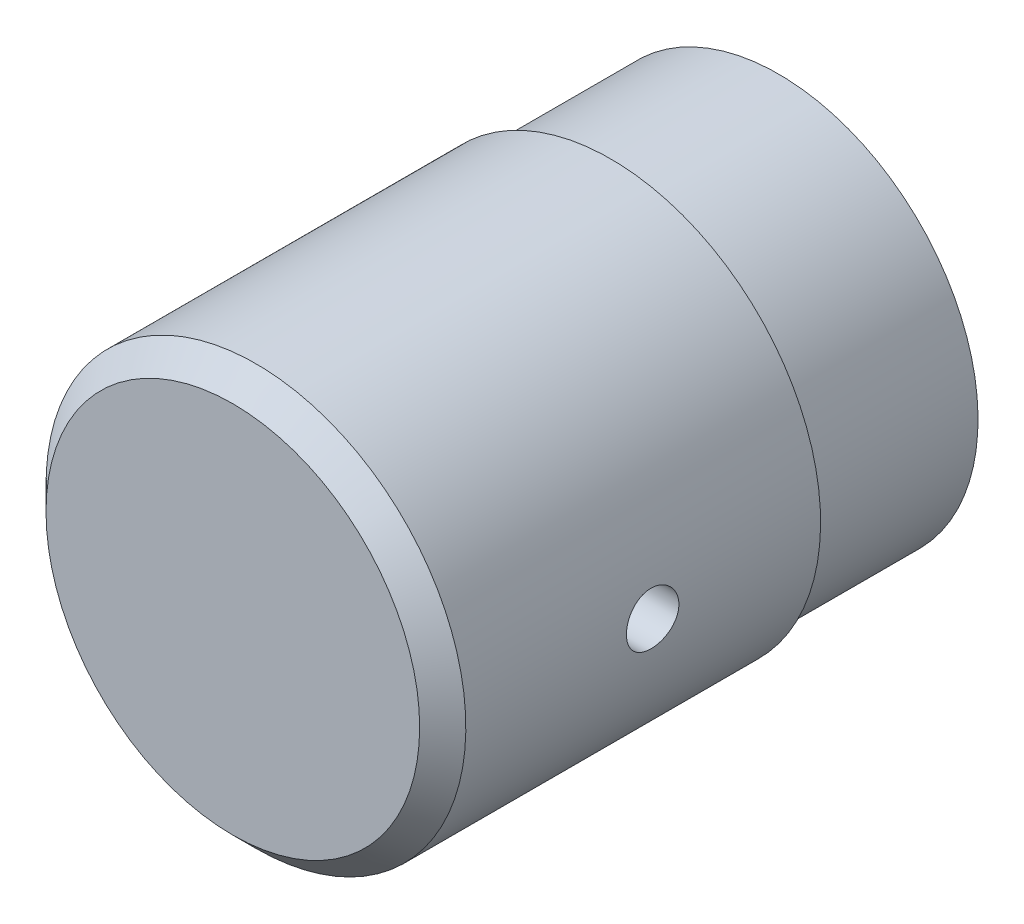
ISO-10303-21;
HEADER;
FILE_DESCRIPTION(('STEP AP214'),'2;1');
FILE_NAME('part.step','',(''),(''),'','','');
FILE_SCHEMA(('AUTOMOTIVE_DESIGN { 1 0 10303 214 1 1 1 1 }'));
ENDSEC;
DATA;
#1=APPLICATION_CONTEXT('core data for automotive mechanical design processes');
#2=APPLICATION_PROTOCOL_DEFINITION('international standard','automotive_design',2000,#1);
#3=PRODUCT_CONTEXT('',#1,'mechanical');
#4=PRODUCT('Part','Part','',(#3));
#5=PRODUCT_RELATED_PRODUCT_CATEGORY('part','',(#4));
#6=PRODUCT_DEFINITION_FORMATION('','',#4);
#7=PRODUCT_DEFINITION_CONTEXT('part definition',#1,'design');
#8=PRODUCT_DEFINITION('design','',#6,#7);
#9=PRODUCT_DEFINITION_SHAPE('','',#8);
#10=(LENGTH_UNIT() NAMED_UNIT(*) SI_UNIT(.MILLI.,.METRE.));
#11=(NAMED_UNIT(*) PLANE_ANGLE_UNIT() SI_UNIT($,.RADIAN.));
#12=(NAMED_UNIT(*) SI_UNIT($,.STERADIAN.) SOLID_ANGLE_UNIT());
#13=UNCERTAINTY_MEASURE_WITH_UNIT(LENGTH_MEASURE(1.E-05),#10,'distance_accuracy_value','');
#14=(GEOMETRIC_REPRESENTATION_CONTEXT(3) GLOBAL_UNCERTAINTY_ASSIGNED_CONTEXT((#13)) GLOBAL_UNIT_ASSIGNED_CONTEXT((#10,
#11,#12)) REPRESENTATION_CONTEXT('',''));
#15=CARTESIAN_POINT('',(0.,0.,0.));
#16=DIRECTION('',(0.,0.,1.));
#17=DIRECTION('',(1.,0.,0.));
#18=AXIS2_PLACEMENT_3D('',#15,#16,#17);
#19=CARTESIAN_POINT('',(0.,0.,0.490836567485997));
#20=DIRECTION('',(0.,0.,-1.));
#21=DIRECTION('',(0.,-1.,0.));
#22=AXIS2_PLACEMENT_3D('',#19,#20,#21);
#23=CYLINDRICAL_SURFACE('',#22,20.);
#24=CARTESIAN_POINT('',(0.,0.,16.));
#25=DIRECTION('',(0.,0.,-1.));
#26=DIRECTION('',(0.,-1.,0.));
#27=AXIS2_PLACEMENT_3D('',#24,#25,#26);
#28=CIRCLE('',#27,20.);
#29=CARTESIAN_POINT('',(0.,-20.,16.));
#30=VERTEX_POINT('',#29);
#31=EDGE_CURVE('E37',#30,#30,#28,.T.);
#32=ORIENTED_EDGE('',*,*,#31,.F.);
#33=EDGE_LOOP('',(#32));
#34=FACE_BOUND('',#33,.T.);
#35=CARTESIAN_POINT('',(0.,0.,49.8));
#36=DIRECTION('',(0.,0.,-1.));
#37=DIRECTION('',(0.,-1.,0.));
#38=AXIS2_PLACEMENT_3D('',#35,#36,#37);
#39=CIRCLE('',#38,20.);
#40=CARTESIAN_POINT('',(0.,-20.,49.8));
#41=VERTEX_POINT('',#40);
#42=EDGE_CURVE('E40',#41,#41,#39,.T.);
#43=ORIENTED_EDGE('',*,*,#42,.T.);
#44=EDGE_LOOP('',(#43));
#45=FACE_BOUND('',#44,.T.);
#46=CARTESIAN_POINT('',(19.8431348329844,2.5,32.));
#47=CARTESIAN_POINT('',(19.8431368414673,2.49999405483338,31.8601637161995));
#48=CARTESIAN_POINT('',(19.8446289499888,2.48822789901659,31.7202400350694));
#49=CARTESIAN_POINT('',(19.8504339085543,2.44147641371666,31.4442867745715));
#50=CARTESIAN_POINT('',(19.854749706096,2.4064668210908,31.3082614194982));
#51=CARTESIAN_POINT('',(19.8657057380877,2.31427669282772,31.0441401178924));
#52=CARTESIAN_POINT('',(19.8723443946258,2.2571112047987,30.9160388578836));
#53=CARTESIAN_POINT('',(19.8871962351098,2.12226419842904,30.6712715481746));
#54=CARTESIAN_POINT('',(19.8954091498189,2.04458618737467,30.5546035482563));
#55=CARTESIAN_POINT('',(19.9125355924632,1.87045345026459,30.3353377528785));
#56=CARTESIAN_POINT('',(19.9214524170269,1.7739068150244,30.2328131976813));
#57=CARTESIAN_POINT('',(19.9389523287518,1.56497526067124,30.0453772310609));
#58=CARTESIAN_POINT('',(19.9475353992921,1.45258955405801,29.9604666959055));
#59=CARTESIAN_POINT('',(19.96343444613,1.21470983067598,29.8104064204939));
#60=CARTESIAN_POINT('',(19.9707461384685,1.08917369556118,29.7453229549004));
#61=CARTESIAN_POINT('',(19.9832423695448,0.82884671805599,29.637188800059));
#62=CARTESIAN_POINT('',(19.9884269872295,0.694056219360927,29.5941372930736));
#63=CARTESIAN_POINT('',(19.9960616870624,0.419795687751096,29.5315079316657));
#64=CARTESIAN_POINT('',(19.9985259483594,0.280353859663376,29.5118083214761));
#65=CARTESIAN_POINT('',(20.0004906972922,0.000123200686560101,29.4960646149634));
#66=CARTESIAN_POINT('',(19.9999913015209,-0.140665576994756,29.5000195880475));
#67=CARTESIAN_POINT('',(19.9960964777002,-0.418765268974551,29.5313752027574));
#68=CARTESIAN_POINT('',(19.9927172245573,-0.556091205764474,29.5586448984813));
#69=CARTESIAN_POINT('',(19.9834605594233,-0.824202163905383,29.63565117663));
#70=CARTESIAN_POINT('',(19.9775830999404,-0.954987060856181,29.685388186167));
#71=CARTESIAN_POINT('',(19.9639625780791,-1.20670881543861,29.806056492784));
#72=CARTESIAN_POINT('',(19.9562145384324,-1.32761822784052,29.8770444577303));
#73=CARTESIAN_POINT('',(19.9397196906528,-1.5558574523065,30.038158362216));
#74=CARTESIAN_POINT('',(19.9309728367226,-1.66318664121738,30.1282851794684));
#75=CARTESIAN_POINT('',(19.9133886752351,-1.86198803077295,30.3258518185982));
#76=CARTESIAN_POINT('',(19.9045511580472,-1.95334683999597,30.4334057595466));
#77=CARTESIAN_POINT('',(19.8878407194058,-2.11673285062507,30.6623815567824));
#78=CARTESIAN_POINT('',(19.8799678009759,-2.18875999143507,30.7838034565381));
#79=CARTESIAN_POINT('',(19.8660780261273,-2.31144457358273,31.0371694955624));
#80=CARTESIAN_POINT('',(19.8600619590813,-2.36209292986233,31.1691180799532));
#81=CARTESIAN_POINT('',(19.8505824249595,-2.44048165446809,31.4397394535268));
#82=CARTESIAN_POINT('',(19.847118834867,-2.46822312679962,31.5784119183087));
#83=CARTESIAN_POINT('',(19.8431588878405,-2.49986043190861,31.8575431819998));
#84=CARTESIAN_POINT('',(19.8426426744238,-2.50391584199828,31.9979836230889));
#85=CARTESIAN_POINT('',(19.8445834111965,-2.48848695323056,32.2775419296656));
#86=CARTESIAN_POINT('',(19.8470402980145,-2.46900315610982,32.4166598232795));
#87=CARTESIAN_POINT('',(19.8546322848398,-2.40718328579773,32.689145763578));
#88=CARTESIAN_POINT('',(19.8597583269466,-2.36492448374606,32.8225316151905));
#89=CARTESIAN_POINT('',(19.8721036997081,-2.25883371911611,33.0803241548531));
#90=CARTESIAN_POINT('',(19.8793231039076,-2.1950009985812,33.2047305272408));
#91=CARTESIAN_POINT('',(19.8950893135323,-2.04718202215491,33.4417546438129));
#92=CARTESIAN_POINT('',(19.9036429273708,-1.96309111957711,33.5543066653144));
#93=CARTESIAN_POINT('',(19.9210923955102,-1.77729074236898,33.7637565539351));
#94=CARTESIAN_POINT('',(19.9299882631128,-1.67558058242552,33.8606538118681));
#95=CARTESIAN_POINT('',(19.9471808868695,-1.45673177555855,34.0366041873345));
#96=CARTESIAN_POINT('',(19.9554739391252,-1.33950849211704,34.115552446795));
#97=CARTESIAN_POINT('',(19.9704711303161,-1.09337258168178,34.2526382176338));
#98=CARTESIAN_POINT('',(19.9771753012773,-0.964460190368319,34.310776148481));
#99=CARTESIAN_POINT('',(19.988222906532,-0.698953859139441,34.404417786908));
#100=CARTESIAN_POINT('',(19.9925726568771,-0.562381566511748,34.4399820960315));
#101=CARTESIAN_POINT('',(19.9984475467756,-0.285146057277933,34.4876640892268));
#102=CARTESIAN_POINT('',(19.9999728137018,-0.144483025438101,34.4997828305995));
#103=CARTESIAN_POINT('',(20.0000262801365,0.135917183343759,34.5002099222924));
#104=CARTESIAN_POINT('',(19.998574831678,0.275654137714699,34.4886799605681));
#105=CARTESIAN_POINT('',(19.9928784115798,0.551187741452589,34.4424793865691));
#106=CARTESIAN_POINT('',(19.9886334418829,0.686984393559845,34.407808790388));
#107=CARTESIAN_POINT('',(19.9778248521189,0.950761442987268,34.3163618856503));
#108=CARTESIAN_POINT('',(19.9712620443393,1.07874456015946,34.259593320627));
#109=CARTESIAN_POINT('',(19.9565444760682,1.32339333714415,34.1255786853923));
#110=CARTESIAN_POINT('',(19.9483896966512,1.44005886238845,34.0483323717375));
#111=CARTESIAN_POINT('',(19.9313319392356,1.65958676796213,33.8749567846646));
#112=CARTESIAN_POINT('',(19.9224244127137,1.76235378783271,33.7787072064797));
#113=CARTESIAN_POINT('',(19.9049015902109,1.95034111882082,33.5703070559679));
#114=CARTESIAN_POINT('',(19.8962863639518,2.03555726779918,33.4581527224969));
#115=CARTESIAN_POINT('',(19.8802881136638,2.18630524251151,33.2206300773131));
#116=CARTESIAN_POINT('',(19.8729099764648,2.25175978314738,33.0952124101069));
#117=CARTESIAN_POINT('',(19.8602785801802,2.36058528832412,32.8351432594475));
#118=CARTESIAN_POINT('',(19.8550230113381,2.40398027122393,32.7005020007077));
#119=CARTESIAN_POINT('',(19.8485078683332,2.4570658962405,32.4709700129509));
#120=CARTESIAN_POINT('',(19.8465030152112,2.47314303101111,32.3775270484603));
#121=CARTESIAN_POINT('',(19.8438158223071,2.49461205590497,32.1894027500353));
#122=CARTESIAN_POINT('',(19.8431334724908,2.5000040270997,32.0947214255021));
#123=CARTESIAN_POINT('',(19.8431348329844,2.5,32.));
#124=B_SPLINE_CURVE_WITH_KNOTS('',3,(#46,#47,#48,#49,#50,#51,#52,#53,#54,#55,#56,#57,#58,#59,
#60,#61,#62,#63,#64,#65,#66,#67,#68,#69,#70,#71,#72,#73,#74,#75,#76,#77,#78,#79,#80,#81,#82,#83,
#84,#85,#86,#87,#88,#89,#90,#91,#92,#93,#94,#95,#96,#97,#98,#99,#100,#101,#102,#103,#104,#105,
#106,#107,#108,#109,#110,#111,#112,#113,#114,#115,#116,#117,#118,#119,#120,#121,#122,#123),
.UNSPECIFIED.,.T.,.F.,(4,2,2,2,2,2,2,2,2,2,2,2,2,2,2,2,2,2,2,2,2,2,2,2,2,2,2,2,2,2,2,2,2,2,2,2,
2,2,4),(0.,0.41916281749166,0.838763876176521,1.25808045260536,1.67732537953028,
2.09866577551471,2.52002712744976,2.94278186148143,3.36552090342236,3.78604596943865,
4.20655449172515,4.62471664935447,5.04288675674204,5.4621820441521,5.881496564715,
6.3036769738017,6.72585870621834,7.14821966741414,7.5705602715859,7.99005217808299,
8.40953514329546,8.82760376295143,9.24568707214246,9.66597819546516,10.0862856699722,
10.5089888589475,10.9316835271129,11.3532385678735,11.7747745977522,12.1934381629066,
12.612101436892,13.030618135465,13.4491398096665,13.8704012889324,14.2917625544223,
14.7147509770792,15.1372778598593,15.4212098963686,15.7051397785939),.UNSPECIFIED.);
#125=CARTESIAN_POINT('',(19.8431348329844,2.5,32.));
#126=VERTEX_POINT('',#125);
#127=EDGE_CURVE('E52',#126,#126,#124,.T.);
#128=ORIENTED_EDGE('',*,*,#127,.T.);
#129=EDGE_LOOP('',(#128));
#130=FACE_BOUND('',#129,.T.);
#131=ADVANCED_FACE('F12',(#34,#45,#130),#23,.T.);
#132=CARTESIAN_POINT('',(0.,0.,44.));
#133=DIRECTION('',(0.,0.,-1.));
#134=DIRECTION('',(0.,-1.,0.));
#135=AXIS2_PLACEMENT_3D('',#132,#133,#134);
#136=CYLINDRICAL_SURFACE('',#135,6.);
#137=CARTESIAN_POINT('',(0.,0.,16.));
#138=DIRECTION('',(0.,0.,-1.));
#139=DIRECTION('',(0.,-1.,0.));
#140=AXIS2_PLACEMENT_3D('',#137,#138,#139);
#141=CIRCLE('',#140,6.);
#142=CARTESIAN_POINT('',(0.,-6.,16.));
#143=VERTEX_POINT('',#142);
#144=EDGE_CURVE('E49',#143,#143,#141,.T.);
#145=ORIENTED_EDGE('',*,*,#144,.T.);
#146=EDGE_LOOP('',(#145));
#147=FACE_BOUND('',#146,.T.);
#148=CARTESIAN_POINT('',(0.,0.,44.));
#149=DIRECTION('',(0.,0.,-1.));
#150=DIRECTION('',(0.,-1.,0.));
#151=AXIS2_PLACEMENT_3D('',#148,#149,#150);
#152=CIRCLE('',#151,6.);
#153=CARTESIAN_POINT('',(0.,-6.,44.));
#154=VERTEX_POINT('',#153);
#155=EDGE_CURVE('E46',#154,#154,#152,.T.);
#156=ORIENTED_EDGE('',*,*,#155,.F.);
#157=EDGE_LOOP('',(#156));
#158=FACE_BOUND('',#157,.T.);
#159=CARTESIAN_POINT('',(5.45435605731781,2.5,32.));
#160=CARTESIAN_POINT('',(5.45435734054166,2.49999850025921,31.9332918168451));
#161=CARTESIAN_POINT('',(5.4555854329,2.49732449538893,31.8665652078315));
#162=CARTESIAN_POINT('',(5.460451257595,2.48666416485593,31.7336135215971));
#163=CARTESIAN_POINT('',(5.46409042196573,2.47867468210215,31.6673887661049));
#164=CARTESIAN_POINT('',(5.478484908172,2.44679265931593,31.4699481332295));
#165=CARTESIAN_POINT('',(5.49271671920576,2.41498683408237,31.3401631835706));
#166=CARTESIAN_POINT('',(5.52853615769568,2.33180001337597,31.0888452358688));
#167=CARTESIAN_POINT('',(5.55009376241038,2.28049881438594,30.9672809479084));
#168=CARTESIAN_POINT('',(5.59808356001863,2.16001268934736,30.7344898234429));
#169=CARTESIAN_POINT('',(5.62451459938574,2.09083199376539,30.623260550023));
#170=CARTESIAN_POINT('',(5.68111508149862,1.93194778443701,30.4073460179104));
#171=CARTESIAN_POINT('',(5.71141131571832,1.84130648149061,30.3033842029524));
#172=CARTESIAN_POINT('',(5.77128595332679,1.64404334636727,30.1116002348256));
#173=CARTESIAN_POINT('',(5.80086407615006,1.53741538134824,30.0237843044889));
#174=CARTESIAN_POINT('',(5.85751074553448,1.3055267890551,29.8631007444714));
#175=CARTESIAN_POINT('',(5.88441479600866,1.17965858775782,29.7910466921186));
#176=CARTESIAN_POINT('',(5.93113040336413,0.916264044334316,29.6694480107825));
#177=CARTESIAN_POINT('',(5.95094510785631,0.778742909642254,29.6198933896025));
#178=CARTESIAN_POINT('',(5.98035041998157,0.503536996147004,29.5473210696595));
#179=CARTESIAN_POINT('',(5.99041942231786,0.366233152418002,29.5230566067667));
#180=CARTESIAN_POINT('',(6.00093657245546,0.0891583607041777,29.4977247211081));
#181=CARTESIAN_POINT('',(6.00138862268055,-0.0506115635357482,29.496647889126));
#182=CARTESIAN_POINT('',(5.99290258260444,-0.319585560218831,29.5170685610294));
#183=CARTESIAN_POINT('',(5.98453429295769,-0.448914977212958,29.5371962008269));
#184=CARTESIAN_POINT('',(5.96013033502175,-0.702165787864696,29.5971062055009));
#185=CARTESIAN_POINT('',(5.94409410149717,-0.826086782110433,29.6368900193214));
#186=CARTESIAN_POINT('',(5.90559704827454,-1.0672762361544,29.7354560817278));
#187=CARTESIAN_POINT('',(5.88304194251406,-1.18441435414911,29.7945189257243));
#188=CARTESIAN_POINT('',(5.83371427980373,-1.40742353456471,29.9296915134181));
#189=CARTESIAN_POINT('',(5.80694023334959,-1.51329059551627,30.0058072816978));
#190=CARTESIAN_POINT('',(5.74963397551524,-1.71868182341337,30.1791648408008));
#191=CARTESIAN_POINT('',(5.71896988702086,-1.81723287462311,30.277517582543));
#192=CARTESIAN_POINT('',(5.65875721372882,-1.99686282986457,30.489422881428));
#193=CARTESIAN_POINT('',(5.62920906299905,-2.07793499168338,30.6029812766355));
#194=CARTESIAN_POINT('',(5.5736322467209,-2.22280378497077,30.8467900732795));
#195=CARTESIAN_POINT('',(5.547751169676,-2.28594506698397,30.9774664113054));
#196=CARTESIAN_POINT('',(5.5041968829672,-2.38892864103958,31.2489620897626));
#197=CARTESIAN_POINT('',(5.48651780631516,-2.42878759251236,31.3897740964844));
#198=CARTESIAN_POINT('',(5.46282425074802,-2.48160050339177,31.6677936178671));
#199=CARTESIAN_POINT('',(5.45612738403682,-2.49613229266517,31.8046422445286));
#200=CARTESIAN_POINT('',(5.45320573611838,-2.50251261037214,32.0789569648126));
#201=CARTESIAN_POINT('',(5.45697733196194,-2.49436898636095,32.2164228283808));
#202=CARTESIAN_POINT('',(5.47386262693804,-2.45706955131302,32.4787967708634));
#203=CARTESIAN_POINT('',(5.48636276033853,-2.42929237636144,32.6039453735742));
#204=CARTESIAN_POINT('',(5.51851260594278,-2.35534117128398,32.8477025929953));
#205=CARTESIAN_POINT('',(5.53816398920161,-2.30916284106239,32.9663096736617));
#206=CARTESIAN_POINT('',(5.58341595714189,-2.19755041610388,33.1992306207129));
#207=CARTESIAN_POINT('',(5.60923324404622,-2.13138366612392,33.3131499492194));
#208=CARTESIAN_POINT('',(5.66360007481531,-1.98240156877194,33.5288161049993));
#209=CARTESIAN_POINT('',(5.69215079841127,-1.89957901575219,33.6305576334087));
#210=CARTESIAN_POINT('',(5.751572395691,-1.71168891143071,33.8276002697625));
#211=CARTESIAN_POINT('',(5.78244293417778,-1.60535932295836,33.9217027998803));
#212=CARTESIAN_POINT('',(5.84086722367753,-1.37770302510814,34.0909445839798));
#213=CARTESIAN_POINT('',(5.86842073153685,-1.25637521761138,34.1660824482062));
#214=CARTESIAN_POINT('',(5.91728503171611,-1.00130936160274,34.2951797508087));
#215=CARTESIAN_POINT('',(5.93857966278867,-0.867540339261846,34.3490844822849));
#216=CARTESIAN_POINT('',(5.97236346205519,-0.591717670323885,34.4332335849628));
#217=CARTESIAN_POINT('',(5.98485787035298,-0.449669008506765,34.4634920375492));
#218=CARTESIAN_POINT('',(5.9990306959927,-0.172033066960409,34.4977162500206));
#219=CARTESIAN_POINT('',(6.00140409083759,-0.0366881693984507,34.5033719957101));
#220=CARTESIAN_POINT('',(5.996990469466,0.232973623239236,34.4927737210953));
#221=CARTESIAN_POINT('',(5.99020505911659,0.367290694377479,34.4765235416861));
#222=CARTESIAN_POINT('',(5.96860132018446,0.626172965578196,34.4237878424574));
#223=CARTESIAN_POINT('',(5.95407648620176,0.750915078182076,34.3880405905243));
#224=CARTESIAN_POINT('',(5.91858999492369,0.992584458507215,34.2981315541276));
#225=CARTESIAN_POINT('',(5.89762711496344,1.10951023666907,34.2439662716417));
#226=CARTESIAN_POINT('',(5.85011651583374,1.33804914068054,34.1160207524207));
#227=CARTESIAN_POINT('',(5.82335921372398,1.44918335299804,34.0414646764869));
#228=CARTESIAN_POINT('',(5.76743120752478,1.65783731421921,33.8759863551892));
#229=CARTESIAN_POINT('',(5.73825960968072,1.75535198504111,33.7850580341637));
#230=CARTESIAN_POINT('',(5.67829702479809,1.94089972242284,33.5821074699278));
#231=CARTESIAN_POINT('',(5.64753091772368,2.02783607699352,33.46907088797));
#232=CARTESIAN_POINT('',(5.58991059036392,2.18166607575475,33.2290936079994));
#233=CARTESIAN_POINT('',(5.56305856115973,2.24854851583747,33.1021451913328));
#234=CARTESIAN_POINT('',(5.51685287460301,2.35965744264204,32.8380710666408));
#235=CARTESIAN_POINT('',(5.49745949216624,2.40400437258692,32.7010040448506));
#236=CARTESIAN_POINT('',(5.47594959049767,2.45239925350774,32.4908362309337));
#237=CARTESIAN_POINT('',(5.47004503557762,2.46550603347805,32.4200894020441));
#238=CARTESIAN_POINT('',(5.46095373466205,2.48558130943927,32.2775739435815));
#239=CARTESIAN_POINT('',(5.45776506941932,2.49255414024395,32.2058060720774));
#240=CARTESIAN_POINT('',(5.45490391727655,2.49880479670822,32.089288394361));
#241=CARTESIAN_POINT('',(5.45435519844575,2.50000100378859,32.0446483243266));
#242=CARTESIAN_POINT('',(5.45435605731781,2.5,32.));
#243=B_SPLINE_CURVE_WITH_KNOTS('',3,(#159,#160,#161,#162,#163,#164,#165,#166,#167,#168,#169,
#170,#171,#172,#173,#174,#175,#176,#177,#178,#179,#180,#181,#182,#183,#184,#185,#186,#187,#188,
#189,#190,#191,#192,#193,#194,#195,#196,#197,#198,#199,#200,#201,#202,#203,#204,#205,#206,#207,
#208,#209,#210,#211,#212,#213,#214,#215,#216,#217,#218,#219,#220,#221,#222,#223,#224,#225,#226,
#227,#228,#229,#230,#231,#232,#233,#234,#235,#236,#237,#238,#239,#240,#241,#242),.UNSPECIFIED.,
.T.,.F.,(4,2,2,2,2,2,2,2,2,2,2,2,2,2,2,2,2,2,2,2,2,2,2,2,2,2,2,2,2,2,2,2,2,2,2,2,2,2,2,2,2,4),
(0.,0.200084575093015,0.400288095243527,0.801278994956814,1.20064597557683,1.59991854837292,
2.02172149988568,2.44368668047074,2.88395420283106,3.32402600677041,3.7411967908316,
4.15819828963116,4.54982147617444,4.94147353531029,5.33910096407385,5.73686909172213,
6.16267530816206,6.58864548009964,7.02861558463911,7.46827048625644,7.87940023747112,
8.29038772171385,8.67506269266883,9.05982760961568,9.46088720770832,9.86212068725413,
10.2960179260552,10.7299469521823,11.1649867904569,11.5997673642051,12.004157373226,
12.4084764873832,12.7984529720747,13.1885035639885,13.5961819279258,14.0040118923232,
14.4395932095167,14.8754174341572,15.3088871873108,15.5252058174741,15.7413714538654,
15.8752896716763),.UNSPECIFIED.);
#244=CARTESIAN_POINT('',(5.45435605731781,2.5,32.));
#245=VERTEX_POINT('',#244);
#246=EDGE_CURVE('E16',#245,#245,#243,.T.);
#247=ORIENTED_EDGE('',*,*,#246,.F.);
#248=EDGE_LOOP('',(#247));
#249=FACE_BOUND('',#248,.T.);
#250=ADVANCED_FACE('F71',(#147,#158,#249),#136,.F.);
#251=CARTESIAN_POINT('',(0.,0.,52.));
#252=DIRECTION('',(0.,0.,-1.));
#253=DIRECTION('',(0.,-1.,0.));
#254=AXIS2_PLACEMENT_3D('',#251,#252,#253);
#255=PLANE('',#254);
#256=CARTESIAN_POINT('',(0.,0.,52.));
#257=DIRECTION('',(0.,0.,-1.));
#258=DIRECTION('',(0.,-1.,0.));
#259=AXIS2_PLACEMENT_3D('',#256,#257,#258);
#260=CIRCLE('',#259,17.8);
#261=CARTESIAN_POINT('',(0.,-17.8,52.));
#262=VERTEX_POINT('',#261);
#263=EDGE_CURVE('E43',#262,#262,#260,.T.);
#264=ORIENTED_EDGE('',*,*,#263,.F.);
#265=EDGE_LOOP('',(#264));
#266=FACE_BOUND('',#265,.T.);
#267=ADVANCED_FACE('F14',(#266),#255,.F.);
#268=CARTESIAN_POINT('',(0.,0.,16.));
#269=DIRECTION('',(0.,0.,-1.));
#270=DIRECTION('',(0.,-1.,0.));
#271=AXIS2_PLACEMENT_3D('',#268,#269,#270);
#272=PLANE('',#271);
#273=ORIENTED_EDGE('',*,*,#144,.F.);
#274=EDGE_LOOP('',(#273));
#275=FACE_BOUND('',#274,.T.);
#276=CARTESIAN_POINT('',(0.,0.,16.));
#277=DIRECTION('',(0.,0.,-1.));
#278=DIRECTION('',(0.,-1.,0.));
#279=AXIS2_PLACEMENT_3D('',#276,#277,#278);
#280=CIRCLE('',#279,16.5);
#281=CARTESIAN_POINT('',(0.,-16.5,16.));
#282=VERTEX_POINT('',#281);
#283=EDGE_CURVE('E8',#282,#282,#280,.T.);
#284=ORIENTED_EDGE('',*,*,#283,.T.);
#285=EDGE_LOOP('',(#284));
#286=FACE_BOUND('',#285,.T.);
#287=ADVANCED_FACE('F116',(#275,#286),#272,.T.);
#288=CARTESIAN_POINT('',(0.,0.,0.490836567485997));
#289=DIRECTION('',(0.,0.,-1.));
#290=DIRECTION('',(0.,-1.,0.));
#291=AXIS2_PLACEMENT_3D('',#288,#289,#290);
#292=CYLINDRICAL_SURFACE('',#291,16.5);
#293=ORIENTED_EDGE('',*,*,#283,.F.);
#294=EDGE_LOOP('',(#293));
#295=FACE_BOUND('',#294,.T.);
#296=CARTESIAN_POINT('',(0.,0.,0.));
#297=DIRECTION('',(0.,0.,-1.));
#298=DIRECTION('',(0.,-1.,0.));
#299=AXIS2_PLACEMENT_3D('',#296,#297,#298);
#300=CIRCLE('',#299,16.5);
#301=CARTESIAN_POINT('',(0.,-16.5,0.));
#302=VERTEX_POINT('',#301);
#303=EDGE_CURVE('E25',#302,#302,#300,.T.);
#304=ORIENTED_EDGE('',*,*,#303,.T.);
#305=EDGE_LOOP('',(#304));
#306=FACE_BOUND('',#305,.T.);
#307=ADVANCED_FACE('F111',(#295,#306),#292,.F.);
#308=CARTESIAN_POINT('',(16.5,0.,0.));
#309=DIRECTION('',(0.,0.,-1.));
#310=DIRECTION('',(0.,-1.,0.));
#311=AXIS2_PLACEMENT_3D('',#308,#309,#310);
#312=PLANE('',#311);
#313=CARTESIAN_POINT('',(0.,0.,0.));
#314=DIRECTION('',(0.,0.,-1.));
#315=DIRECTION('',(0.,-1.,0.));
#316=AXIS2_PLACEMENT_3D('',#313,#314,#315);
#317=CIRCLE('',#316,19.);
#318=CARTESIAN_POINT('',(0.,-19.,0.));
#319=VERTEX_POINT('',#318);
#320=EDGE_CURVE('E29',#319,#319,#317,.T.);
#321=ORIENTED_EDGE('',*,*,#320,.T.);
#322=EDGE_LOOP('',(#321));
#323=FACE_BOUND('',#322,.T.);
#324=ORIENTED_EDGE('',*,*,#303,.F.);
#325=EDGE_LOOP('',(#324));
#326=FACE_BOUND('',#325,.T.);
#327=ADVANCED_FACE('F105',(#323,#326),#312,.T.);
#328=CARTESIAN_POINT('',(0.,0.,0.490836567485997));
#329=DIRECTION('',(0.,0.,-1.));
#330=DIRECTION('',(0.,-1.,0.));
#331=AXIS2_PLACEMENT_3D('',#328,#329,#330);
#332=CYLINDRICAL_SURFACE('',#331,19.);
#333=CARTESIAN_POINT('',(0.,0.,16.));
#334=DIRECTION('',(0.,0.,-1.));
#335=DIRECTION('',(0.,-1.,0.));
#336=AXIS2_PLACEMENT_3D('',#333,#334,#335);
#337=CIRCLE('',#336,19.);
#338=CARTESIAN_POINT('',(0.,-19.,16.));
#339=VERTEX_POINT('',#338);
#340=EDGE_CURVE('E34',#339,#339,#337,.T.);
#341=ORIENTED_EDGE('',*,*,#340,.T.);
#342=EDGE_LOOP('',(#341));
#343=FACE_BOUND('',#342,.T.);
#344=ORIENTED_EDGE('',*,*,#320,.F.);
#345=EDGE_LOOP('',(#344));
#346=FACE_BOUND('',#345,.T.);
#347=ADVANCED_FACE('F83',(#343,#346),#332,.T.);
#348=CARTESIAN_POINT('',(19.,0.,16.));
#349=DIRECTION('',(0.,0.,-1.));
#350=DIRECTION('',(0.,-1.,0.));
#351=AXIS2_PLACEMENT_3D('',#348,#349,#350);
#352=PLANE('',#351);
#353=ORIENTED_EDGE('',*,*,#31,.T.);
#354=EDGE_LOOP('',(#353));
#355=FACE_BOUND('',#354,.T.);
#356=ORIENTED_EDGE('',*,*,#340,.F.);
#357=EDGE_LOOP('',(#356));
#358=FACE_BOUND('',#357,.T.);
#359=ADVANCED_FACE('F76',(#355,#358),#352,.T.);
#360=CARTESIAN_POINT('',(0.,0.,52.));
#361=DIRECTION('',(0.,0.,-1.));
#362=DIRECTION('',(0.,-1.,0.));
#363=AXIS2_PLACEMENT_3D('',#360,#361,#362);
#364=CONICAL_SURFACE('',#363,17.8,0.785398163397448);
#365=ORIENTED_EDGE('',*,*,#42,.F.);
#366=EDGE_LOOP('',(#365));
#367=FACE_BOUND('',#366,.T.);
#368=ORIENTED_EDGE('',*,*,#263,.T.);
#369=EDGE_LOOP('',(#368));
#370=FACE_BOUND('',#369,.T.);
#371=ADVANCED_FACE('F69',(#367,#370),#364,.T.);
#372=CARTESIAN_POINT('',(0.,0.,44.));
#373=DIRECTION('',(0.,0.,-1.));
#374=DIRECTION('',(0.,-1.,0.));
#375=AXIS2_PLACEMENT_3D('',#372,#373,#374);
#376=PLANE('',#375);
#377=ORIENTED_EDGE('',*,*,#155,.T.);
#378=EDGE_LOOP('',(#377));
#379=FACE_BOUND('',#378,.T.);
#380=ADVANCED_FACE('F65',(#379),#376,.T.);
#381=CARTESIAN_POINT('',(2.5,0.,32.));
#382=DIRECTION('',(1.,0.,0.));
#383=DIRECTION('',(0.,1.,0.));
#384=AXIS2_PLACEMENT_3D('',#381,#382,#383);
#385=CYLINDRICAL_SURFACE('',#384,2.5);
#386=ORIENTED_EDGE('',*,*,#127,.F.);
#387=EDGE_LOOP('',(#386));
#388=FACE_BOUND('',#387,.T.);
#389=ORIENTED_EDGE('',*,*,#246,.T.);
#390=EDGE_LOOP('',(#389));
#391=FACE_BOUND('',#390,.T.);
#392=ADVANCED_FACE('F61',(#388,#391),#385,.F.);
#393=CLOSED_SHELL('',(#131,#250,#267,#287,#307,#327,#347,#359,#371,#380,#392));
#394=MANIFOLD_SOLID_BREP('B1',#393);
#395=ADVANCED_BREP_SHAPE_REPRESENTATION('',(#18,#394),#14);
#396=SHAPE_DEFINITION_REPRESENTATION(#9,#395);
ENDSEC;
END-ISO-10303-21;
